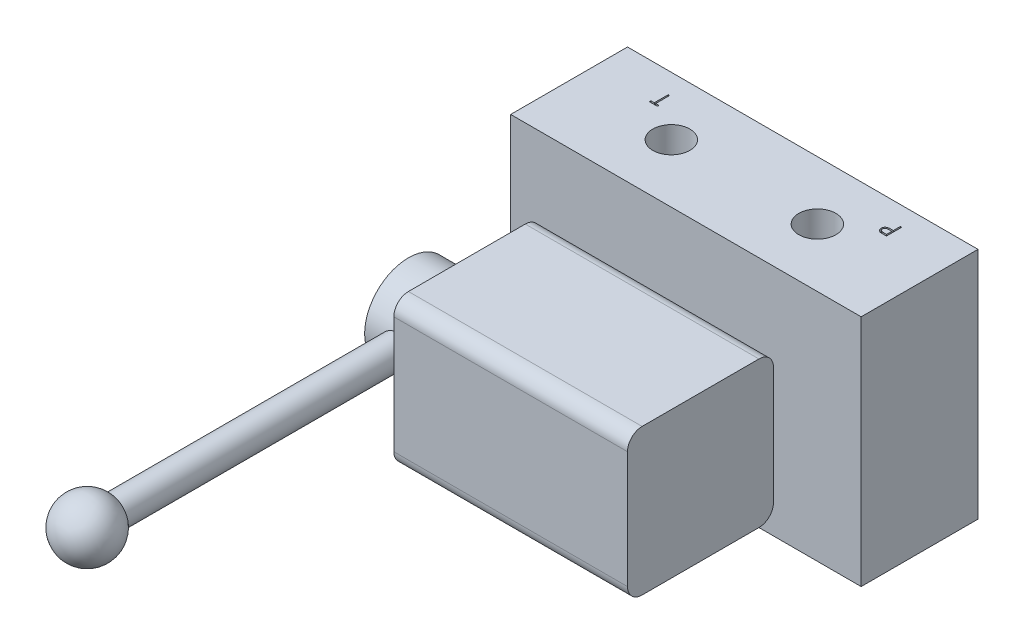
from build123d import *

# Parameters (mm, degrees)
SZKIC1_W                    = 120
SZKIC1_H                    = 80
DODANIE_WYCI_GNI_CIE1_DEPTH = 20
SZKIC2_W                    = 50
SZKIC2_H                    = 20
DODANIE_WYCI_GNI_CIE2_DEPTH = 10
SZKIC3_W                    = 80
SZKIC3_H                    = 50
DODANIE_WYCI_GNI_CIE3_DEPTH = 50
SZKIC4_R                    = 15
DODANIE_WYCI_GNI_CIE4_DEPTH = 20
SZKIC5_R                    = 5
DODANIE_WYCI_GNI_CIE5_DEPTH = 120
ZAOKR_GLENIE1_R             = 5
ZAOKR_GLENIE2_R             = 2
SZKIC7_R                    = 6.35
WYTNIJ_WYCI_GNI_CIE1_DEPTH  = 20
LUSTRO2_COPY_1_SKETCH_R     = 6.35
LUSTRO2_COPY_1_DEPTH        = 20
WYTNIJ_WYCI_GNI_CIE2_DEPTH  = 2
WYTNIJ_WYCI_GNI_CIE3_DEPTH  = 2
WYTNIJ_WYCI_GNI_CIE4_DEPTH  = 2
WYTNIJ_WYCI_GNI_CIE5_DEPTH  = 2


with BuildPart() as part:
    # Szkic1 → Dodanie-wyci_gni_cie1 (new, symmetric)
    with BuildSketch(Plane.XY):
        Rectangle(SZKIC1_W, SZKIC1_H)
    extrude(amount=DODANIE_WYCI_GNI_CIE1_DEPTH, both=True)

    # Szkic2 → Dodanie-wyci_gni_cie2 (add)
    with BuildSketch(Plane.XY.offset(20)):
        Rectangle(SZKIC2_W, SZKIC2_H)
    extrude(amount=DODANIE_WYCI_GNI_CIE2_DEPTH)

    # Szkic3 → Dodanie-wyci_gni_cie3 (add)
    with BuildSketch(Plane.XY.offset(30)):
        Rectangle(SZKIC3_W, SZKIC3_H)
    extrude(amount=DODANIE_WYCI_GNI_CIE3_DEPTH)

    # Szkic4 → Dodanie-wyci_gni_cie4 (add)
    with BuildSketch(Plane.ZY.offset(40)):
        with Locations(Location((55, 0, 0), (0, 0, 180))):
            Circle(SZKIC4_R)
    extrude(amount=DODANIE_WYCI_GNI_CIE4_DEPTH)

    # Szkic5 → Dodanie-wyci_gni_cie5 (add)
    with BuildSketch(Plane.XY.offset(55)):
        with Locations(Location((-50, 0, 0), (0, 0, 180))):
            Circle(SZKIC5_R)
    extrude(amount=DODANIE_WYCI_GNI_CIE5_DEPTH)

    # Szkic6 → Obr_t1 (revolve)
    with BuildSketch(Plane.XY.offset(175)):
        with BuildLine():
            Line((-50, 10), (-50, -10))
            ThreePointArc((-50, -10), (-60, 0), (-50, 10))
        make_face()
    revolve(axis=Axis((-50, 10, 175), (0, -1, 0)))

    # Zaokr_glenie1
    zaokr_glenie1_edges = [part.edges().sort_by_distance(p)[0] for p in [
        (0, -25, 30),
        (0, 25, 30),
        (0, -25, 80),
        (0, 25, 80),
    ]]
    fillet(zaokr_glenie1_edges, radius=ZAOKR_GLENIE1_R)

    # Zaokr_glenie2
    zaokr_glenie2_edges = [part.edges().sort_by_distance(p)[0] for p in [
        (-25, 0, 20),
        (0, -10, 20),
        (25, 0, 20),
        (0, 10, 20),
    ]]
    fillet(zaokr_glenie2_edges, radius=ZAOKR_GLENIE2_R)

    # Szkic7 → Wytnij-wyci_gni_cie1 (cut)
    with BuildSketch(Plane.XZ.offset(40)):
        with Locations((-25, 0)):
            Circle(SZKIC7_R)
    wytnij_wyci_gni_cie1 = extrude(amount=-WYTNIJ_WYCI_GNI_CIE1_DEPTH, mode=Mode.SUBTRACT)

    # Lustro1: Wytnij-wyci_gni_cie1 across plane
    add(wytnij_wyci_gni_cie1.mirror(Plane(origin=(0, 0, 0), x_dir=(0, 0, 1), z_dir=(1, 0, 0))), mode=Mode.SUBTRACT)

    # Lustro2: Wytnij-wyci_gni_cie1 across plane
    add(wytnij_wyci_gni_cie1.mirror(Plane.ZX), mode=Mode.SUBTRACT)

    # Lustro2 copy 1 sketch → Lustro2 copy 1 (cut)
    with BuildSketch(Plane(origin=(0, 40, 0), x_dir=(-1, 0, 0), z_dir=(0, 1, 0))):
        with Locations((-25, 0)):
            Circle(LUSTRO2_COPY_1_SKETCH_R)
    extrude(amount=-LUSTRO2_COPY_1_DEPTH, mode=Mode.SUBTRACT)

    # Szkic8 → Wytnij-wyci_gni_cie2 (cut)
    with BuildSketch(Plane.XZ.offset(40)):
        Polygon((-38.354384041, -10.029701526), (-35.912076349, -15.321368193), (-36.428310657, -15.321368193), (-37.21061234, -13.625321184), (-39.609458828, -13.625321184), (-40.414021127, -15.321368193), (-40.932375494, -15.321368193), (-38.422225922, -10.029701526), align=None)
        Polygon((-38.393605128, -11.061110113), (-39.351871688, -13.082586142), (-37.460779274, -13.082586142), align=None, mode=Mode.SUBTRACT)
    extrude(amount=-WYTNIJ_WYCI_GNI_CIE2_DEPTH, mode=Mode.SUBTRACT)

    # Szkic9 → Wytnij-wyci_gni_cie3 (cut)
    with BuildSketch(Plane.XZ.offset(40)):
        with BuildLine():
            Line((35.678240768, -7.782596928), (36.710709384, -7.782596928))
            add(Edge.make_bspline(
                [(36.710709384, -7.782596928), (36.76125006, -7.782862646), (36.859210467, -7.783377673), (37.00166129, -7.791365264), (37.135085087, -7.802256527), (37.259520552, -7.819537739), (37.374910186, -7.840389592), (37.481601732, -7.865641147), (37.579255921, -7.89591948), (37.695843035, -7.944068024), (37.828770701, -8.015616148), (37.972701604, -8.121341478), (38.095777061, -8.250658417), (38.201892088, -8.396531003), (38.286258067, -8.556998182), (38.3472926, -8.728235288), (38.385933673, -8.908033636), (38.389907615, -9.031470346), (38.391915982, -9.093853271)],
                knots=[0, 0, 0, 0, 1.001505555, 1.941167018, 2.826882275, 3.653841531, 4.429895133, 5.150066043, 5.825578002, 6.45369114, 7.647487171, 8.808567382, 9.977351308, 11.170798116, 12.373658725, 13.556498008, 14.765093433, 16, 16, 16, 16], degree=3))
            add(Edge.make_bspline(
                [(38.391915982, -9.093853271), (38.390263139, -9.152292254), (38.387015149, -9.267130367), (38.355956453, -9.43509408), (38.307332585, -9.594979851), (38.239742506, -9.746204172), (38.151897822, -9.88535023), (38.047790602, -10.013540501), (37.922186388, -10.125347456), (37.828080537, -10.187853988), (37.780279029, -10.219604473)],
                knots=[0, 0, 0, 0, 1.044552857, 2.05264487, 3.044412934, 4.028983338, 5.005914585, 5.980388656, 6.974128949, 8, 8, 8, 8], degree=3))
            add(Edge.make_bspline(
                [(37.780279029, -10.219604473), (37.840393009, -10.242683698), (37.955405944, -10.286839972), (38.113681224, -10.364907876), (38.25004724, -10.449819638), (38.365552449, -10.542547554), (38.464336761, -10.64249778), (38.550595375, -10.751135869), (38.624196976, -10.869878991), (38.687262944, -10.997489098), (38.736473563, -11.132663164), (38.773327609, -11.274133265), (38.794445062, -11.421392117), (38.797450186, -11.521609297), (38.798967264, -11.572201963)],
                knots=[0, 0, 0, 0, 1.27268992, 2.434971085, 3.483601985, 4.442670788, 5.356604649, 6.2567628, 7.179492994, 8.113709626, 9.066344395, 10.018646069, 10.999752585, 12, 12, 12, 12], degree=3))
            add(Edge.make_bspline(
                [(38.798967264, -11.572201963), (38.797490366, -11.623859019), (38.794584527, -11.725495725), (38.77314576, -11.874804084), (38.736846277, -12.017490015), (38.686845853, -12.154476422), (38.621588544, -12.285498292), (38.542171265, -12.41070406), (38.447478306, -12.528835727), (38.34154992, -12.641205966), (38.221713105, -12.742243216), (38.092421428, -12.832225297), (37.952046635, -12.906227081), (37.802894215, -12.96839059), (37.643291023, -13.015875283), (37.473953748, -13.049095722), (37.295028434, -13.071479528), (37.172247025, -13.073319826), (37.109280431, -13.074263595)],
                knots=[0, 0, 0, 0, 0.978564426, 1.925352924, 2.850884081, 3.763762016, 4.682927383, 5.618979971, 6.567305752, 7.547517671, 8.540179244, 9.531824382, 10.526200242, 11.540722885, 12.589160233, 13.674978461, 14.80764778, 16, 16, 16, 16], degree=3))
            Line((37.109280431, -13.074263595), (35.678240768, -13.074263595))
            Line((35.678240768, -13.074263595), (35.678240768, -7.782596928))
        make_face()
        with BuildLine():
            Line((36.15313393, -8.325331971), (36.15313393, -10.021378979))
            Line((36.15313393, -10.021378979), (36.472202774, -10.021378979))
            add(Edge.make_bspline(
                [(36.472202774, -10.021378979), (36.518843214, -10.020774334), (36.60896205, -10.019606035), (36.739469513, -10.016259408), (36.86061091, -10.006888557), (36.972177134, -9.997520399), (37.073992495, -9.982288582), (37.165831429, -9.964157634), (37.24913526, -9.944982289), (37.345201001, -9.91237128), (37.454168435, -9.864175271), (37.570332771, -9.789378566), (37.672740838, -9.700290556), (37.759217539, -9.597494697), (37.829992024, -9.484304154), (37.879149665, -9.362524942), (37.912483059, -9.235192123), (37.915494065, -9.147776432), (37.917022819, -9.103393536)],
                knots=[0, 0, 0, 0, 1.156816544, 2.235205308, 3.236616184, 4.169592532, 5.011045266, 5.787822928, 6.49130361, 7.128639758, 8.301311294, 9.436451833, 10.541879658, 11.654887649, 12.756523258, 13.837046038, 14.901820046, 16, 16, 16, 16], degree=3))
            add(Edge.make_bspline(
                [(37.917022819, -9.103393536), (37.916227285, -9.074023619), (37.914666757, -9.016411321), (37.901886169, -8.932425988), (37.880163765, -8.85343841), (37.852262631, -8.778366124), (37.81327259, -8.709556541), (37.767365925, -8.644630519), (37.711900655, -8.585799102), (37.648767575, -8.530811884), (37.57618311, -8.482061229), (37.494190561, -8.439363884), (37.401680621, -8.404981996), (37.300212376, -8.37487067), (37.188223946, -8.353721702), (37.067007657, -8.33610289), (36.935570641, -8.327133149), (36.844636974, -8.325945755), (36.797631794, -8.325331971)],
                knots=[0, 0, 0, 0, 0.91205012, 1.789085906, 2.630437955, 3.453916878, 4.269457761, 5.079663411, 5.91843418, 6.774407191, 7.675494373, 8.627863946, 9.638891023, 10.736472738, 11.911756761, 13.175263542, 14.539845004, 16, 16, 16, 16], degree=3))
            Line((36.797631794, -8.325331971), (36.15313393, -8.325331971))
        make_face(mode=Mode.SUBTRACT)
        with BuildLine():
            Line((36.15313393, -10.564114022), (36.15313393, -12.531528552))
            Line((36.15313393, -12.531528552), (36.829432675, -12.531528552))
            add(Edge.make_bspline(
                [(36.829432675, -12.531528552), (36.877842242, -12.530948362), (36.971145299, -12.529830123), (37.105857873, -12.526179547), (37.230715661, -12.517875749), (37.345148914, -12.504804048), (37.450393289, -12.490624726), (37.545186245, -12.47155767), (37.630296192, -12.449712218), (37.728984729, -12.415945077), (37.840115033, -12.363487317), (37.959874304, -12.284393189), (38.066352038, -12.190166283), (38.156771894, -12.081111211), (38.230874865, -11.962530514), (38.284782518, -11.836822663), (38.318030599, -11.706064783), (38.322055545, -11.616912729), (38.324074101, -11.572201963)],
                knots=[0, 0, 0, 0, 1.160039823, 2.235823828, 3.228722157, 4.157150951, 4.99529583, 5.772374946, 6.472645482, 7.099169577, 8.269452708, 9.405989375, 10.527446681, 11.663510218, 12.788923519, 13.866172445, 14.929861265, 16, 16, 16, 16], degree=3))
            add(Edge.make_bspline(
                [(38.324074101, -11.572201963), (38.323656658, -11.544241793), (38.322828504, -11.488772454), (38.310339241, -11.40725687), (38.292175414, -11.328296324), (38.268693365, -11.251676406), (38.234494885, -11.178782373), (38.194570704, -11.108172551), (38.147760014, -11.0397536), (38.07481943, -10.953254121), (37.968726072, -10.853593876), (37.817978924, -10.756019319), (37.646570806, -10.677327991), (37.522250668, -10.643915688), (37.458030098, -10.626655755)],
                knots=[0, 0, 0, 0, 0.723448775, 1.435228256, 2.130040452, 2.821711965, 3.505591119, 4.210454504, 4.921174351, 5.648778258, 7.137944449, 8.670945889, 10.280296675, 12, 12, 12, 12], degree=3))
            add(Edge.make_bspline(
                [(37.458030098, -10.626655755), (37.432283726, -10.621431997), (37.376460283, -10.610105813), (37.285432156, -10.598150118), (37.181510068, -10.587498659), (37.064454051, -10.579619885), (36.934116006, -10.571475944), (36.790217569, -10.568308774), (36.633346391, -10.564530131), (36.524500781, -10.564256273), (36.467962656, -10.564114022)],
                knots=[0, 0, 0, 0, 0.634451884, 1.375622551, 2.216452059, 3.157844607, 4.20941857, 5.370758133, 6.634282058, 8, 8, 8, 8], degree=3))
            Line((36.467962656, -10.564114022), (36.15313393, -10.564114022))
        make_face(mode=Mode.SUBTRACT)
    extrude(amount=-WYTNIJ_WYCI_GNI_CIE3_DEPTH, mode=Mode.SUBTRACT)

    # Szkic10 → Wytnij-wyci_gni_cie4 (cut)
    with BuildSketch(Plane(origin=(0, 40, 0), x_dir=(1, 0, 0), z_dir=(0, 1, 0))):
        with BuildLine():
            Line((40.39629152, 8.263010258), (39.358522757, 8.263010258))
            add(Edge.make_bspline(
                [(39.358522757, 8.263010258), (39.287144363, 8.26308872), (39.150380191, 8.263239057), (38.95426338, 8.267797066), (38.776146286, 8.273885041), (38.616412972, 8.282324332), (38.474571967, 8.292297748), (38.351265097, 8.30628595), (38.245523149, 8.320891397), (38.182164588, 8.335740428), (38.153269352, 8.342512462)],
                knots=[0, 0, 0, 0, 1.415646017, 2.712440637, 3.8905458, 4.950247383, 5.884950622, 6.709939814, 7.411656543, 8, 8, 8, 8], degree=3))
            add(Edge.make_bspline(
                [(38.153269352, 8.342512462), (38.116691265, 8.352524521), (38.044397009, 8.372312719), (37.940221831, 8.411941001), (37.841123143, 8.4589505), (37.746686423, 8.51244814), (37.658529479, 8.574960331), (37.573899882, 8.642879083), (37.494572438, 8.71895119), (37.421744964, 8.803076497), (37.354267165, 8.892499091), (37.29778341, 8.989499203), (37.247906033, 9.090711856), (37.209036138, 9.198608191), (37.178482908, 9.311763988), (37.156230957, 9.430473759), (37.141929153, 9.554481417), (37.140572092, 9.639241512), (37.139881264, 9.682389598)],
                knots=[0, 0, 0, 0, 0.999333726, 1.975119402, 2.933498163, 3.889020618, 4.832249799, 5.779334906, 6.747801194, 7.724875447, 8.710438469, 9.696133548, 10.679360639, 11.681339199, 12.714023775, 13.766351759, 14.862936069, 16, 16, 16, 16], degree=3))
            add(Edge.make_bspline(
                [(37.139881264, 9.682389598), (37.140518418, 9.725898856), (37.141765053, 9.811027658), (37.156727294, 9.935567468), (37.176881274, 10.054582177), (37.207870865, 10.167807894), (37.248458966, 10.274572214), (37.296071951, 10.376506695), (37.353499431, 10.471877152), (37.419486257, 10.561029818), (37.492891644, 10.644048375), (37.573405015, 10.720331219), (37.660701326, 10.789431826), (37.754503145, 10.851505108), (37.85572494, 10.905111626), (37.96283153, 10.953125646), (38.076753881, 10.99344975), (38.155588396, 11.014661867), (38.195670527, 11.025446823)],
                knots=[0, 0, 0, 0, 1.121902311, 2.195077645, 3.232258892, 4.234102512, 5.217864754, 6.176164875, 7.132989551, 8.084763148, 9.034132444, 9.988522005, 10.94243251, 11.903244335, 12.886203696, 13.894208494, 14.929344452, 16, 16, 16, 16], degree=3))
            add(Edge.make_bspline(
                [(38.195670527, 11.025446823), (38.228822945, 11.032491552), (38.301478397, 11.047930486), (38.421127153, 11.065283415), (38.560504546, 11.079514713), (38.719136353, 11.092795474), (38.8973925, 11.099832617), (39.094864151, 11.108095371), (39.312219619, 11.111994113), (39.463818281, 11.112240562), (39.542967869, 11.112369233)],
                knots=[0, 0, 0, 0, 0.601372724, 1.317943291, 2.144091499, 3.08771165, 4.142394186, 5.309582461, 6.595334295, 8, 8, 8, 8], degree=3))
            Line((39.542967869, 11.112369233), (39.921398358, 11.112369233))
            Line((39.921398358, 11.112369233), (39.921398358, 13.554676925))
            Line((39.921398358, 13.554676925), (40.39629152, 13.554676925))
            Line((40.39629152, 13.554676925), (40.39629152, 8.263010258))
        make_face()
        with BuildLine():
            Line((39.921398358, 8.805745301), (39.921398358, 10.56963419))
            Line((39.921398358, 10.56963419), (38.99493268, 10.581294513))
            add(Edge.make_bspline(
                [(38.99493268, 10.581294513), (38.94969584, 10.581324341), (38.862367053, 10.581381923), (38.735877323, 10.575253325), (38.618806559, 10.568586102), (38.510981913, 10.557803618), (38.412895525, 10.544652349), (38.324309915, 10.527069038), (38.244518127, 10.509135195), (38.152606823, 10.478016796), (38.049656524, 10.431070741), (37.937918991, 10.360950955), (37.842448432, 10.272617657), (37.760530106, 10.172225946), (37.695779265, 10.060426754), (37.648851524, 9.941140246), (37.620207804, 9.814819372), (37.616607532, 9.728473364), (37.614774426, 9.684509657)],
                knots=[0, 0, 0, 0, 1.160501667, 2.240324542, 3.248665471, 4.168823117, 5.020172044, 5.786515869, 6.485785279, 7.116517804, 8.272762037, 9.381837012, 10.485674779, 11.594342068, 12.695271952, 13.786226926, 14.872841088, 16, 16, 16, 16], degree=3))
            add(Edge.make_bspline(
                [(37.614774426, 9.684509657), (37.616689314, 9.641970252), (37.620495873, 9.55740718), (37.648614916, 9.433413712), (37.696276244, 9.315483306), (37.760582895, 9.204570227), (37.840538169, 9.104445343), (37.934110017, 9.01808067), (38.039842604, 8.948178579), (38.137429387, 8.901645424), (38.224761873, 8.874357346), (38.300252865, 8.854656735), (38.385923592, 8.841069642), (38.480963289, 8.82806935), (38.585250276, 8.817575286), (38.699447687, 8.810287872), (38.82317514, 8.806067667), (38.90906691, 8.805855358), (38.953591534, 8.805745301)],
                knots=[0, 0, 0, 0, 1.12039168, 2.227199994, 3.330242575, 4.460839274, 5.593542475, 6.693949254, 7.801736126, 8.92216649, 9.528704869, 10.210659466, 10.975987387, 11.81211542, 12.738540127, 13.736887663, 14.826846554, 16, 16, 16, 16], degree=3))
            Line((38.953591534, 8.805745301), (39.921398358, 8.805745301))
        make_face(mode=Mode.SUBTRACT)
    extrude(amount=-WYTNIJ_WYCI_GNI_CIE4_DEPTH, mode=Mode.SUBTRACT)

    # Szkic11 → Wytnij-wyci_gni_cie5 (cut)
    with BuildSketch(Plane(origin=(0, 40, 0), x_dir=(1, 0, 0), z_dir=(0, 1, 0))):
        Polygon((-37.250058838, 8.067472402), (-37.250058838, 7.524737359), (-40.031575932, 7.524737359), (-40.031575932, 8.067472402), (-38.878263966, 8.067472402), (-38.878263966, 12.816404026), (-38.403370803, 12.816404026), (-38.403370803, 8.067472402), align=None)
    extrude(amount=-WYTNIJ_WYCI_GNI_CIE5_DEPTH, mode=Mode.SUBTRACT)


solid = part.part
